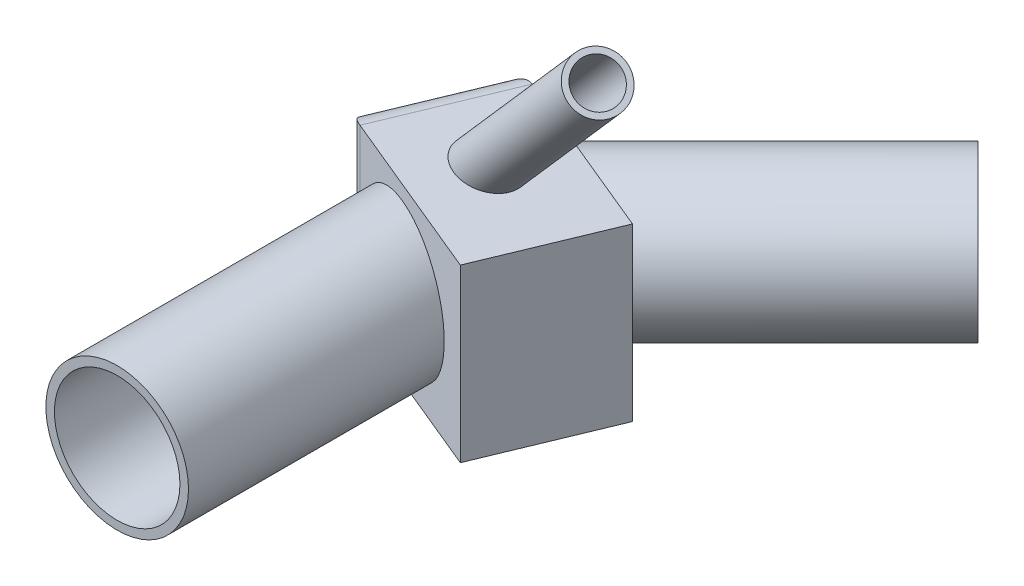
ISO-10303-21;
HEADER;
FILE_DESCRIPTION(('STEP AP214'),'2;1');
FILE_NAME('part.step','',(''),(''),'','','');
FILE_SCHEMA(('AUTOMOTIVE_DESIGN { 1 0 10303 214 1 1 1 1 }'));
ENDSEC;
DATA;
#1=APPLICATION_CONTEXT('core data for automotive mechanical design processes');
#2=APPLICATION_PROTOCOL_DEFINITION('international standard','automotive_design',2000,#1);
#3=PRODUCT_CONTEXT('',#1,'mechanical');
#4=PRODUCT('Part','Part','',(#3));
#5=PRODUCT_RELATED_PRODUCT_CATEGORY('part','',(#4));
#6=PRODUCT_DEFINITION_FORMATION('','',#4);
#7=PRODUCT_DEFINITION_CONTEXT('part definition',#1,'design');
#8=PRODUCT_DEFINITION('design','',#6,#7);
#9=PRODUCT_DEFINITION_SHAPE('','',#8);
#10=(LENGTH_UNIT() NAMED_UNIT(*) SI_UNIT(.MILLI.,.METRE.));
#11=(NAMED_UNIT(*) PLANE_ANGLE_UNIT() SI_UNIT($,.RADIAN.));
#12=(NAMED_UNIT(*) SI_UNIT($,.STERADIAN.) SOLID_ANGLE_UNIT());
#13=UNCERTAINTY_MEASURE_WITH_UNIT(LENGTH_MEASURE(1.E-05),#10,'distance_accuracy_value','');
#14=(GEOMETRIC_REPRESENTATION_CONTEXT(3) GLOBAL_UNCERTAINTY_ASSIGNED_CONTEXT((#13)) GLOBAL_UNIT_ASSIGNED_CONTEXT((#10,
#11,#12)) REPRESENTATION_CONTEXT('',''));
#15=CARTESIAN_POINT('',(0.,0.,0.));
#16=DIRECTION('',(0.,0.,1.));
#17=DIRECTION('',(1.,0.,0.));
#18=AXIS2_PLACEMENT_3D('',#15,#16,#17);
#19=CARTESIAN_POINT('',(-4.30982448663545,7.62,-39.8851877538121));
#20=DIRECTION('',(0.,1.,0.));
#21=DIRECTION('',(0.,0.,1.));
#22=AXIS2_PLACEMENT_3D('',#19,#20,#21);
#23=PLANE('',#22);
#24=DIRECTION('',(-0.923879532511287,0.,-0.38268343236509));
#25=VECTOR('',#24,1.);
#26=CARTESIAN_POINT('',(-4.30982448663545,7.62,-39.8851877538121));
#27=LINE('',#26,#25);
#28=CARTESIAN_POINT('',(13.2900806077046,7.62,-32.5950683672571));
#29=VERTEX_POINT('',#28);
#30=CARTESIAN_POINT('',(-1.96317047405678,7.62,-38.9131718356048));
#31=VERTEX_POINT('',#30);
#32=EDGE_CURVE('E119',#29,#31,#27,.T.);
#33=ORIENTED_EDGE('',*,*,#32,.T.);
#34=DIRECTION('',(-0.382683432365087,0.,0.923879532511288));
#35=VECTOR('',#34,1.);
#36=CARTESIAN_POINT('',(-6.45329853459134,7.62,-28.0730437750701));
#37=LINE('',#36,#35);
#38=CARTESIAN_POINT('',(-6.45329853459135,7.62,-28.0730437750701));
#39=VERTEX_POINT('',#38);
#40=EDGE_CURVE('E12',#31,#39,#37,.T.);
#41=ORIENTED_EDGE('',*,*,#40,.T.);
#42=DIRECTION('',(0.923879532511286,0.,0.382683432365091));
#43=VECTOR('',#42,1.);
#44=CARTESIAN_POINT('',(8.79995254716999,7.62,-21.7549403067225));
#45=LINE('',#44,#43);
#46=CARTESIAN_POINT('',(8.79995254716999,7.62,-21.7549403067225));
#47=VERTEX_POINT('',#46);
#48=EDGE_CURVE('E113',#39,#47,#45,.T.);
#49=ORIENTED_EDGE('',*,*,#48,.T.);
#50=DIRECTION('',(0.38268343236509,0.,-0.923879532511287));
#51=VECTOR('',#50,1.);
#52=CARTESIAN_POINT('',(13.2900806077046,7.62,-32.5950683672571));
#53=LINE('',#52,#51);
#54=EDGE_CURVE('E106',#47,#29,#53,.T.);
#55=ORIENTED_EDGE('',*,*,#54,.T.);
#56=EDGE_LOOP('',(#33,#41,#49,#55));
#57=FACE_BOUND('',#56,.T.);
#58=CARTESIAN_POINT('',(2.24487076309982,7.62,-30.8195974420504));
#59=DIRECTION('',(0.,1.,0.));
#60=DIRECTION('',(-0.923879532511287,0.,-0.382683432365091));
#61=AXIS2_PLACEMENT_3D('',#58,#59,#60);
#62=ELLIPSE('',#61,3.36759604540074,2.38124999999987);
#63=CARTESIAN_POINT('',(-0.866382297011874,7.62,-32.1083206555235));
#64=VERTEX_POINT('',#63);
#65=EDGE_CURVE('E145',#64,#64,#62,.F.);
#66=ORIENTED_EDGE('',*,*,#65,.T.);
#67=EDGE_LOOP('',(#66));
#68=FACE_BOUND('',#67,.T.);
#69=ADVANCED_FACE('F36',(#57,#68),#23,.T.);
#70=CARTESIAN_POINT('',(0.,0.,-31.75));
#71=DIRECTION('',(0.707106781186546,0.,-0.707106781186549));
#72=DIRECTION('',(-0.707106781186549,0.,-0.707106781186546));
#73=AXIS2_PLACEMENT_3D('',#70,#71,#72);
#74=CYLINDRICAL_SURFACE('',#73,6.35);
#75=CARTESIAN_POINT('',(22.4506403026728,0.,-54.2006403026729));
#76=DIRECTION('',(0.707106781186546,0.,-0.707106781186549));
#77=DIRECTION('',(-0.707106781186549,0.,-0.707106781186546));
#78=AXIS2_PLACEMENT_3D('',#75,#76,#77);
#79=CIRCLE('',#78,6.35);
#80=CARTESIAN_POINT('',(17.9605122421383,0.,-58.6907683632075));
#81=VERTEX_POINT('',#80);
#82=EDGE_CURVE('E126',#81,#81,#79,.T.);
#83=ORIENTED_EDGE('',*,*,#82,.F.);
#84=EDGE_LOOP('',(#83));
#85=FACE_BOUND('',#84,.T.);
#86=CARTESIAN_POINT('',(4.49012806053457,0.,-36.2401280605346));
#87=DIRECTION('',(-0.38268343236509,0.,0.923879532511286));
#88=DIRECTION('',(0.923879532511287,0.,0.38268343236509));
#89=AXIS2_PLACEMENT_3D('',#86,#87,#88);
#90=ELLIPSE('',#89,6.87319047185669,6.35);
#91=CARTESIAN_POINT('',(10.8401280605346,0.,-33.6098719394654));
#92=VERTEX_POINT('',#91);
#93=EDGE_CURVE('E125',#92,#92,#90,.T.);
#94=ORIENTED_EDGE('',*,*,#93,.F.);
#95=EDGE_LOOP('',(#94));
#96=FACE_BOUND('',#95,.T.);
#97=ADVANCED_FACE('F216',(#85,#96),#74,.T.);
#98=CARTESIAN_POINT('',(0.,0.,-31.75));
#99=DIRECTION('',(0.707106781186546,0.,-0.707106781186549));
#100=DIRECTION('',(-0.707106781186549,0.,-0.707106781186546));
#101=AXIS2_PLACEMENT_3D('',#98,#99,#100);
#102=CYLINDRICAL_SURFACE('',#101,5.588);
#103=CARTESIAN_POINT('',(22.4506403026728,0.,-54.2006403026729));
#104=DIRECTION('',(0.707106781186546,0.,-0.707106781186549));
#105=DIRECTION('',(-0.707106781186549,0.,-0.707106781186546));
#106=AXIS2_PLACEMENT_3D('',#103,#104,#105);
#107=CIRCLE('',#106,5.588);
#108=CARTESIAN_POINT('',(18.4993276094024,0.,-58.1519529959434));
#109=VERTEX_POINT('',#108);
#110=EDGE_CURVE('E131',#109,#109,#107,.T.);
#111=ORIENTED_EDGE('',*,*,#110,.T.);
#112=EDGE_LOOP('',(#111));
#113=FACE_BOUND('',#112,.T.);
#114=CARTESIAN_POINT('',(4.49012806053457,0.,-36.2401280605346));
#115=DIRECTION('',(-0.38268343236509,0.,0.923879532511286));
#116=DIRECTION('',(0.923879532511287,0.,0.38268343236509));
#117=AXIS2_PLACEMENT_3D('',#114,#115,#116);
#118=ELLIPSE('',#117,6.04840761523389,5.588);
#119=CARTESIAN_POINT('',(10.0781280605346,0.,-33.9255026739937));
#120=VERTEX_POINT('',#119);
#121=EDGE_CURVE('E136',#120,#120,#118,.T.);
#122=ORIENTED_EDGE('',*,*,#121,.T.);
#123=EDGE_LOOP('',(#122));
#124=FACE_BOUND('',#123,.T.);
#125=ADVANCED_FACE('F38',(#113,#124),#102,.F.);
#126=CARTESIAN_POINT('',(22.4506403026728,0.,-54.2006403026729));
#127=DIRECTION('',(0.707106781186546,0.,-0.707106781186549));
#128=DIRECTION('',(-0.707106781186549,0.,-0.707106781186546));
#129=AXIS2_PLACEMENT_3D('',#126,#127,#128);
#130=PLANE('',#129);
#131=ORIENTED_EDGE('',*,*,#110,.F.);
#132=EDGE_LOOP('',(#131));
#133=FACE_BOUND('',#132,.T.);
#134=ORIENTED_EDGE('',*,*,#82,.T.);
#135=EDGE_LOOP('',(#134));
#136=FACE_BOUND('',#135,.T.);
#137=ADVANCED_FACE('F295',(#133,#136),#130,.T.);
#138=CARTESIAN_POINT('',(-4.30982448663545,-7.62,-39.8851877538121));
#139=DIRECTION('',(0.,1.,0.));
#140=DIRECTION('',(0.,0.,1.));
#141=AXIS2_PLACEMENT_3D('',#138,#139,#140);
#142=PLANE('',#141);
#143=DIRECTION('',(0.923879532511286,0.,0.382683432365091));
#144=VECTOR('',#143,1.);
#145=CARTESIAN_POINT('',(8.79995254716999,-7.62,-21.7549403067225));
#146=LINE('',#145,#144);
#147=CARTESIAN_POINT('',(-6.45329853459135,-7.62,-28.0730437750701));
#148=VERTEX_POINT('',#147);
#149=CARTESIAN_POINT('',(8.79995254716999,-7.62,-21.7549403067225));
#150=VERTEX_POINT('',#149);
#151=EDGE_CURVE('E90',#148,#150,#146,.T.);
#152=ORIENTED_EDGE('',*,*,#151,.F.);
#153=DIRECTION('',(-0.382683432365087,0.,0.923879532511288));
#154=VECTOR('',#153,1.);
#155=CARTESIAN_POINT('',(-1.96317047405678,-7.62,-38.9131718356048));
#156=LINE('',#155,#154);
#157=CARTESIAN_POINT('',(-1.96317047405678,-7.62,-38.9131718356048));
#158=VERTEX_POINT('',#157);
#159=EDGE_CURVE('E44',#148,#158,#156,.F.);
#160=ORIENTED_EDGE('',*,*,#159,.T.);
#161=DIRECTION('',(-0.923879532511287,0.,-0.38268343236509));
#162=VECTOR('',#161,1.);
#163=CARTESIAN_POINT('',(-4.30982448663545,-7.62,-39.8851877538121));
#164=LINE('',#163,#162);
#165=CARTESIAN_POINT('',(13.2900806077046,-7.62,-32.5950683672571));
#166=VERTEX_POINT('',#165);
#167=EDGE_CURVE('E111',#166,#158,#164,.T.);
#168=ORIENTED_EDGE('',*,*,#167,.F.);
#169=DIRECTION('',(0.38268343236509,0.,-0.923879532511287));
#170=VECTOR('',#169,1.);
#171=CARTESIAN_POINT('',(13.2900806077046,-7.62,-32.5950683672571));
#172=LINE('',#171,#170);
#173=EDGE_CURVE('E99',#150,#166,#172,.T.);
#174=ORIENTED_EDGE('',*,*,#173,.F.);
#175=EDGE_LOOP('',(#152,#160,#168,#174));
#176=FACE_BOUND('',#175,.T.);
#177=ADVANCED_FACE('F110',(#176),#142,.F.);
#178=CARTESIAN_POINT('',(13.2900806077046,7.62,-32.5950683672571));
#179=DIRECTION('',(-0.923879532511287,0.,-0.38268343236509));
#180=DIRECTION('',(-0.38268343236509,0.,0.923879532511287));
#181=AXIS2_PLACEMENT_3D('',#178,#179,#180);
#182=PLANE('',#181);
#183=DIRECTION('',(0.,-1.,0.));
#184=VECTOR('',#183,1.);
#185=CARTESIAN_POINT('',(8.79995254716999,7.62,-21.7549403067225));
#186=LINE('',#185,#184);
#187=EDGE_CURVE('E94',#47,#150,#186,.T.);
#188=ORIENTED_EDGE('',*,*,#187,.T.);
#189=ORIENTED_EDGE('',*,*,#173,.T.);
#190=DIRECTION('',(0.,-1.,0.));
#191=VECTOR('',#190,1.);
#192=CARTESIAN_POINT('',(13.2900806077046,7.62,-32.5950683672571));
#193=LINE('',#192,#191);
#194=EDGE_CURVE('E108',#29,#166,#193,.T.);
#195=ORIENTED_EDGE('',*,*,#194,.F.);
#196=ORIENTED_EDGE('',*,*,#54,.F.);
#197=EDGE_LOOP('',(#188,#189,#195,#196));
#198=FACE_BOUND('',#197,.T.);
#199=ADVANCED_FACE('F104',(#198),#182,.F.);
#200=CARTESIAN_POINT('',(8.79995254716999,7.62,-21.7549403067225));
#201=DIRECTION('',(0.382683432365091,0.,-0.923879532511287));
#202=DIRECTION('',(-0.923879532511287,0.,-0.382683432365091));
#203=AXIS2_PLACEMENT_3D('',#200,#201,#202);
#204=PLANE('',#203);
#205=CARTESIAN_POINT('',(0.,0.,-25.4));
#206=DIRECTION('',(0.382683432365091,0.,-0.923879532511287));
#207=DIRECTION('',(0.923879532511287,0.,0.382683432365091));
#208=AXIS2_PLACEMENT_3D('',#205,#206,#207);
#209=ELLIPSE('',#208,6.8731904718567,6.35);
#210=CARTESIAN_POINT('',(6.35,0.,-22.7697438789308));
#211=VERTEX_POINT('',#210);
#212=EDGE_CURVE('E107',#211,#211,#209,.F.);
#213=ORIENTED_EDGE('',*,*,#212,.F.);
#214=EDGE_LOOP('',(#213));
#215=FACE_BOUND('',#214,.T.);
#216=ORIENTED_EDGE('',*,*,#48,.F.);
#217=DIRECTION('',(0.,-1.,0.));
#218=VECTOR('',#217,1.);
#219=CARTESIAN_POINT('',(-6.45329853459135,7.62,-28.0730437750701));
#220=LINE('',#219,#218);
#221=EDGE_CURVE('E97',#39,#148,#220,.T.);
#222=ORIENTED_EDGE('',*,*,#221,.T.);
#223=ORIENTED_EDGE('',*,*,#151,.T.);
#224=ORIENTED_EDGE('',*,*,#187,.F.);
#225=EDGE_LOOP('',(#216,#222,#223,#224));
#226=FACE_BOUND('',#225,.T.);
#227=ADVANCED_FACE('F93',(#215,#226),#204,.F.);
#228=CARTESIAN_POINT('',(-4.30982448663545,7.62,-39.8851877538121));
#229=DIRECTION('',(0.923879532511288,0.,0.382683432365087));
#230=DIRECTION('',(0.382683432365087,0.,-0.923879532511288));
#231=AXIS2_PLACEMENT_3D('',#228,#229,#230);
#232=PLANE('',#231);
#233=DIRECTION('',(0.,-1.,0.));
#234=VECTOR('',#233,1.);
#235=CARTESIAN_POINT('',(-5.28184040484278,7.62,-37.5385337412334));
#236=LINE('',#235,#234);
#237=CARTESIAN_POINT('',(-5.28184040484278,5.08,-37.5385337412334));
#238=VERTEX_POINT('',#237);
#239=CARTESIAN_POINT('',(-5.28184040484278,-5.08,-37.5385337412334));
#240=VERTEX_POINT('',#239);
#241=EDGE_CURVE('E154',#238,#240,#236,.T.);
#242=ORIENTED_EDGE('',*,*,#241,.T.);
#243=DIRECTION('',(-0.382683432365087,0.,0.923879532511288));
#244=VECTOR('',#243,1.);
#245=CARTESIAN_POINT('',(-4.30982448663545,-5.08,-39.8851877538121));
#246=LINE('',#245,#244);
#247=CARTESIAN_POINT('',(-7.82793662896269,-5.08,-31.3917137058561));
#248=VERTEX_POINT('',#247);
#249=EDGE_CURVE('E159',#240,#248,#246,.T.);
#250=ORIENTED_EDGE('',*,*,#249,.T.);
#251=DIRECTION('',(0.,-1.,0.));
#252=VECTOR('',#251,1.);
#253=CARTESIAN_POINT('',(-7.82793662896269,7.62,-31.3917137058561));
#254=LINE('',#253,#252);
#255=CARTESIAN_POINT('',(-7.82793662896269,5.08,-31.3917137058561));
#256=VERTEX_POINT('',#255);
#257=EDGE_CURVE('E156',#248,#256,#254,.F.);
#258=ORIENTED_EDGE('',*,*,#257,.T.);
#259=DIRECTION('',(-0.382683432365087,0.,0.923879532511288));
#260=VECTOR('',#259,1.);
#261=CARTESIAN_POINT('',(-4.30982448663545,5.08,-39.8851877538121));
#262=LINE('',#261,#260);
#263=EDGE_CURVE('E152',#256,#238,#262,.F.);
#264=ORIENTED_EDGE('',*,*,#263,.T.);
#265=EDGE_LOOP('',(#242,#250,#258,#264));
#266=FACE_BOUND('',#265,.T.);
#267=ADVANCED_FACE('F164',(#266),#232,.F.);
#268=CARTESIAN_POINT('',(-4.30982448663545,7.62,-39.8851877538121));
#269=DIRECTION('',(-0.38268343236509,0.,0.923879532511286));
#270=DIRECTION('',(0.923879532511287,0.,0.382683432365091));
#271=AXIS2_PLACEMENT_3D('',#268,#269,#270);
#272=PLANE('',#271);
#273=ORIENTED_EDGE('',*,*,#167,.T.);
#274=DIRECTION('',(0.,-1.,0.));
#275=VECTOR('',#274,1.);
#276=CARTESIAN_POINT('',(-1.96317047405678,7.62,-38.9131718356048));
#277=LINE('',#276,#275);
#278=EDGE_CURVE('E51',#158,#31,#277,.F.);
#279=ORIENTED_EDGE('',*,*,#278,.T.);
#280=ORIENTED_EDGE('',*,*,#32,.F.);
#281=ORIENTED_EDGE('',*,*,#194,.T.);
#282=EDGE_LOOP('',(#273,#279,#280,#281));
#283=FACE_BOUND('',#282,.T.);
#284=ORIENTED_EDGE('',*,*,#93,.T.);
#285=EDGE_LOOP('',(#284));
#286=FACE_BOUND('',#285,.T.);
#287=ADVANCED_FACE('F263',(#283,#286),#272,.F.);
#288=ORIENTED_EDGE('',*,*,#121,.F.);
#289=EDGE_LOOP('',(#288));
#290=FACE_BOUND('',#289,.T.);
#291=ADVANCED_FACE('F268',(#290),#272,.F.);
#292=CARTESIAN_POINT('',(0.,0.,-49.7105122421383));
#293=DIRECTION('',(0.,0.,1.));
#294=DIRECTION('',(1.,0.,0.));
#295=AXIS2_PLACEMENT_3D('',#292,#293,#294);
#296=CYLINDRICAL_SURFACE('',#295,5.588);
#297=CARTESIAN_POINT('',(0.,0.,0.));
#298=DIRECTION('',(0.,0.,1.));
#299=DIRECTION('',(1.,0.,0.));
#300=AXIS2_PLACEMENT_3D('',#297,#298,#299);
#301=CIRCLE('',#300,5.588);
#302=CARTESIAN_POINT('',(5.588,0.,0.));
#303=VERTEX_POINT('',#302);
#304=EDGE_CURVE('E132',#303,#303,#301,.T.);
#305=ORIENTED_EDGE('',*,*,#304,.T.);
#306=EDGE_LOOP('',(#305));
#307=FACE_BOUND('',#306,.T.);
#308=CARTESIAN_POINT('',(0.,0.,-25.4));
#309=DIRECTION('',(0.382683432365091,0.,-0.923879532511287));
#310=DIRECTION('',(0.923879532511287,0.,0.382683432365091));
#311=AXIS2_PLACEMENT_3D('',#308,#309,#310);
#312=ELLIPSE('',#311,6.0484076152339,5.588);
#313=CARTESIAN_POINT('',(5.588,0.,-23.0853746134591));
#314=VERTEX_POINT('',#313);
#315=EDGE_CURVE('E122',#314,#314,#312,.F.);
#316=ORIENTED_EDGE('',*,*,#315,.F.);
#317=EDGE_LOOP('',(#316));
#318=FACE_BOUND('',#317,.T.);
#319=ADVANCED_FACE('F344',(#307,#318),#296,.F.);
#320=CARTESIAN_POINT('',(0.,0.,0.));
#321=DIRECTION('',(0.,0.,1.));
#322=DIRECTION('',(1.,0.,0.));
#323=AXIS2_PLACEMENT_3D('',#320,#321,#322);
#324=PLANE('',#323);
#325=ORIENTED_EDGE('',*,*,#304,.F.);
#326=EDGE_LOOP('',(#325));
#327=FACE_BOUND('',#326,.T.);
#328=CARTESIAN_POINT('',(0.,0.,0.));
#329=DIRECTION('',(0.,0.,1.));
#330=DIRECTION('',(1.,0.,0.));
#331=AXIS2_PLACEMENT_3D('',#328,#329,#330);
#332=CIRCLE('',#331,6.35);
#333=CARTESIAN_POINT('',(6.35,0.,0.));
#334=VERTEX_POINT('',#333);
#335=EDGE_CURVE('E135',#334,#334,#332,.T.);
#336=ORIENTED_EDGE('',*,*,#335,.T.);
#337=EDGE_LOOP('',(#336));
#338=FACE_BOUND('',#337,.T.);
#339=ADVANCED_FACE('F335',(#327,#338),#324,.T.);
#340=CARTESIAN_POINT('',(0.,0.,-49.7105122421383));
#341=DIRECTION('',(0.,0.,1.));
#342=DIRECTION('',(1.,0.,0.));
#343=AXIS2_PLACEMENT_3D('',#340,#341,#342);
#344=CYLINDRICAL_SURFACE('',#343,6.35);
#345=ORIENTED_EDGE('',*,*,#335,.F.);
#346=EDGE_LOOP('',(#345));
#347=FACE_BOUND('',#346,.T.);
#348=ORIENTED_EDGE('',*,*,#212,.T.);
#349=EDGE_LOOP('',(#348));
#350=FACE_BOUND('',#349,.T.);
#351=ADVANCED_FACE('F210',(#347,#350),#344,.T.);
#352=ORIENTED_EDGE('',*,*,#315,.T.);
#353=EDGE_LOOP('',(#352));
#354=FACE_BOUND('',#353,.T.);
#355=ADVANCED_FACE('F201',(#354),#204,.F.);
#356=CARTESIAN_POINT('',(2.24487076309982,7.62,-30.8195974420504));
#357=DIRECTION('',(-0.653281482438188,-0.707106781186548,-0.270598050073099));
#358=DIRECTION('',(0.734509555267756,-0.678598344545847,0.));
#359=AXIS2_PLACEMENT_3D('',#356,#357,#358);
#360=CYLINDRICAL_SURFACE('',#359,1.87959999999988);
#361=CARTESIAN_POINT('',(2.24487076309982,7.62,-30.8195974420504));
#362=DIRECTION('',(0.,1.,0.));
#363=DIRECTION('',(-0.923879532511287,0.,-0.382683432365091));
#364=AXIS2_PLACEMENT_3D('',#361,#362,#363);
#365=ELLIPSE('',#364,2.6581558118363,1.87959999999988);
#366=CARTESIAN_POINT('',(-0.21094498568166,7.62,-31.8368296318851));
#367=VERTEX_POINT('',#366);
#368=EDGE_CURVE('E100',#367,#367,#365,.T.);
#369=ORIENTED_EDGE('',*,*,#368,.F.);
#370=EDGE_LOOP('',(#369));
#371=FACE_BOUND('',#370,.T.);
#372=CARTESIAN_POINT('',(18.8382204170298,25.5805122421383,-23.9464069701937));
#373=DIRECTION('',(-0.653281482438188,-0.707106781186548,-0.270598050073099));
#374=DIRECTION('',(0.734509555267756,-0.678598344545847,0.));
#375=AXIS2_PLACEMENT_3D('',#372,#373,#374);
#376=CIRCLE('',#375,1.8796);
#377=CARTESIAN_POINT('',(20.2188045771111,24.3050187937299,-23.9464069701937));
#378=VERTEX_POINT('',#377);
#379=EDGE_CURVE('E185',#378,#378,#376,.T.);
#380=ORIENTED_EDGE('',*,*,#379,.F.);
#381=EDGE_LOOP('',(#380));
#382=FACE_BOUND('',#381,.T.);
#383=ADVANCED_FACE('F199',(#371,#382),#360,.F.);
#384=CARTESIAN_POINT('',(2.24487076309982,7.62,-30.8195974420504));
#385=DIRECTION('',(-0.653281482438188,-0.707106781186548,-0.270598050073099));
#386=DIRECTION('',(0.734509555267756,-0.678598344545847,0.));
#387=AXIS2_PLACEMENT_3D('',#384,#385,#386);
#388=CYLINDRICAL_SURFACE('',#387,2.38124999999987);
#389=ORIENTED_EDGE('',*,*,#65,.F.);
#390=EDGE_LOOP('',(#389));
#391=FACE_BOUND('',#390,.T.);
#392=CARTESIAN_POINT('',(18.8382204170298,25.5805122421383,-23.9464069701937));
#393=DIRECTION('',(-0.653281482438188,-0.707106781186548,-0.270598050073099));
#394=DIRECTION('',(0.734509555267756,-0.678598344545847,0.));
#395=AXIS2_PLACEMENT_3D('',#392,#393,#394);
#396=CIRCLE('',#395,2.38125);
#397=CARTESIAN_POINT('',(20.5872712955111,23.9645999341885,-23.9464069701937));
#398=VERTEX_POINT('',#397);
#399=EDGE_CURVE('E148',#398,#398,#396,.T.);
#400=ORIENTED_EDGE('',*,*,#399,.T.);
#401=EDGE_LOOP('',(#400));
#402=FACE_BOUND('',#401,.T.);
#403=ADVANCED_FACE('F190',(#391,#402),#388,.T.);
#404=CARTESIAN_POINT('',(17.610312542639,26.9095901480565,-24.4550230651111));
#405=DIRECTION('',(-0.653281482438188,-0.707106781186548,-0.270598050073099));
#406=DIRECTION('',(0.734509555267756,-0.678598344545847,0.));
#407=AXIS2_PLACEMENT_3D('',#404,#405,#406);
#408=PLANE('',#407);
#409=ORIENTED_EDGE('',*,*,#399,.F.);
#410=EDGE_LOOP('',(#409));
#411=FACE_BOUND('',#410,.T.);
#412=ORIENTED_EDGE('',*,*,#379,.T.);
#413=EDGE_LOOP('',(#412));
#414=FACE_BOUND('',#413,.T.);
#415=ADVANCED_FACE('F192',(#411,#414),#408,.F.);
#416=ORIENTED_EDGE('',*,*,#368,.T.);
#417=EDGE_LOOP('',(#416));
#418=FACE_BOUND('',#417,.T.);
#419=ADVANCED_FACE('F195',(#418),#23,.T.);
#420=CARTESIAN_POINT('',(-2.93518639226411,7.62,-36.5665178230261));
#421=DIRECTION('',(0.,-1.,0.));
#422=DIRECTION('',(0.,0.,-1.));
#423=AXIS2_PLACEMENT_3D('',#420,#421,#422);
#424=CYLINDRICAL_SURFACE('',#423,2.54);
#425=CARTESIAN_POINT('',(-2.93518639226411,-5.08,-36.5665178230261));
#426=DIRECTION('',(-0.270598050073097,-0.707106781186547,0.653281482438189));
#427=DIRECTION('',(-0.270598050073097,0.707106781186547,0.653281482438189));
#428=AXIS2_PLACEMENT_3D('',#425,#426,#427);
#429=ELLIPSE('',#428,3.59210244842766,2.54);
#430=EDGE_CURVE('E178',#240,#158,#429,.T.);
#431=ORIENTED_EDGE('',*,*,#430,.F.);
#432=ORIENTED_EDGE('',*,*,#241,.F.);
#433=CARTESIAN_POINT('',(-2.93518639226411,5.08,-36.5665178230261));
#434=DIRECTION('',(0.270598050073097,-0.707106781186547,-0.653281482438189));
#435=DIRECTION('',(0.270598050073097,0.707106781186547,-0.653281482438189));
#436=AXIS2_PLACEMENT_3D('',#433,#434,#435);
#437=ELLIPSE('',#436,3.59210244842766,2.54);
#438=EDGE_CURVE('E182',#31,#238,#437,.F.);
#439=ORIENTED_EDGE('',*,*,#438,.F.);
#440=ORIENTED_EDGE('',*,*,#278,.F.);
#441=EDGE_LOOP('',(#431,#432,#439,#440));
#442=FACE_BOUND('',#441,.T.);
#443=ADVANCED_FACE('F226',(#442),#424,.T.);
#444=CARTESIAN_POINT('',(-1.96317047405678,5.08,-38.9131718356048));
#445=DIRECTION('',(0.382683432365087,0.,-0.923879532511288));
#446=DIRECTION('',(-0.923879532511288,0.,-0.382683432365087));
#447=AXIS2_PLACEMENT_3D('',#444,#445,#446);
#448=CYLINDRICAL_SURFACE('',#447,2.54);
#449=ORIENTED_EDGE('',*,*,#438,.T.);
#450=ORIENTED_EDGE('',*,*,#263,.F.);
#451=CARTESIAN_POINT('',(-5.48128261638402,5.08,-30.4196977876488));
#452=DIRECTION('',(0.270598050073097,0.707106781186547,-0.653281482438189));
#453=DIRECTION('',(0.270598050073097,-0.707106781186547,-0.653281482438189));
#454=AXIS2_PLACEMENT_3D('',#451,#452,#453);
#455=ELLIPSE('',#454,3.59210244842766,2.54);
#456=EDGE_CURVE('E174',#39,#256,#455,.F.);
#457=ORIENTED_EDGE('',*,*,#456,.F.);
#458=ORIENTED_EDGE('',*,*,#40,.F.);
#459=EDGE_LOOP('',(#449,#450,#457,#458));
#460=FACE_BOUND('',#459,.T.);
#461=ADVANCED_FACE('F231',(#460),#448,.T.);
#462=CARTESIAN_POINT('',(-1.96317047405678,-5.08,-38.9131718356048));
#463=DIRECTION('',(-0.382683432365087,0.,0.923879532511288));
#464=DIRECTION('',(0.923879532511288,0.,0.382683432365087));
#465=AXIS2_PLACEMENT_3D('',#462,#463,#464);
#466=CYLINDRICAL_SURFACE('',#465,2.54);
#467=ORIENTED_EDGE('',*,*,#430,.T.);
#468=ORIENTED_EDGE('',*,*,#159,.F.);
#469=CARTESIAN_POINT('',(-5.48128261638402,-5.08,-30.4196977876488));
#470=DIRECTION('',(-0.270598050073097,0.707106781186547,0.653281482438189));
#471=DIRECTION('',(-0.270598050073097,-0.707106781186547,0.653281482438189));
#472=AXIS2_PLACEMENT_3D('',#469,#470,#471);
#473=ELLIPSE('',#472,3.59210244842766,2.54);
#474=EDGE_CURVE('E172',#248,#148,#473,.T.);
#475=ORIENTED_EDGE('',*,*,#474,.F.);
#476=ORIENTED_EDGE('',*,*,#249,.F.);
#477=EDGE_LOOP('',(#467,#468,#475,#476));
#478=FACE_BOUND('',#477,.T.);
#479=ADVANCED_FACE('F176',(#478),#466,.T.);
#480=CARTESIAN_POINT('',(-5.48128261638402,7.62,-30.4196977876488));
#481=DIRECTION('',(0.,-1.,0.));
#482=DIRECTION('',(0.,0.,-1.));
#483=AXIS2_PLACEMENT_3D('',#480,#481,#482);
#484=CYLINDRICAL_SURFACE('',#483,2.54);
#485=ORIENTED_EDGE('',*,*,#456,.T.);
#486=ORIENTED_EDGE('',*,*,#257,.F.);
#487=ORIENTED_EDGE('',*,*,#474,.T.);
#488=ORIENTED_EDGE('',*,*,#221,.F.);
#489=EDGE_LOOP('',(#485,#486,#487,#488));
#490=FACE_BOUND('',#489,.T.);
#491=ADVANCED_FACE('F171',(#490),#484,.T.);
#492=CLOSED_SHELL('',(#69,#97,#125,#137,#177,#199,#227,#267,#287,#291,#319,#339,#351,#355,#383,
#403,#415,#419,#443,#461,#479,#491));
#493=MANIFOLD_SOLID_BREP('B2',#492);
#494=ADVANCED_BREP_SHAPE_REPRESENTATION('',(#18,#493),#14);
#495=SHAPE_DEFINITION_REPRESENTATION(#9,#494);
ENDSEC;
END-ISO-10303-21;
